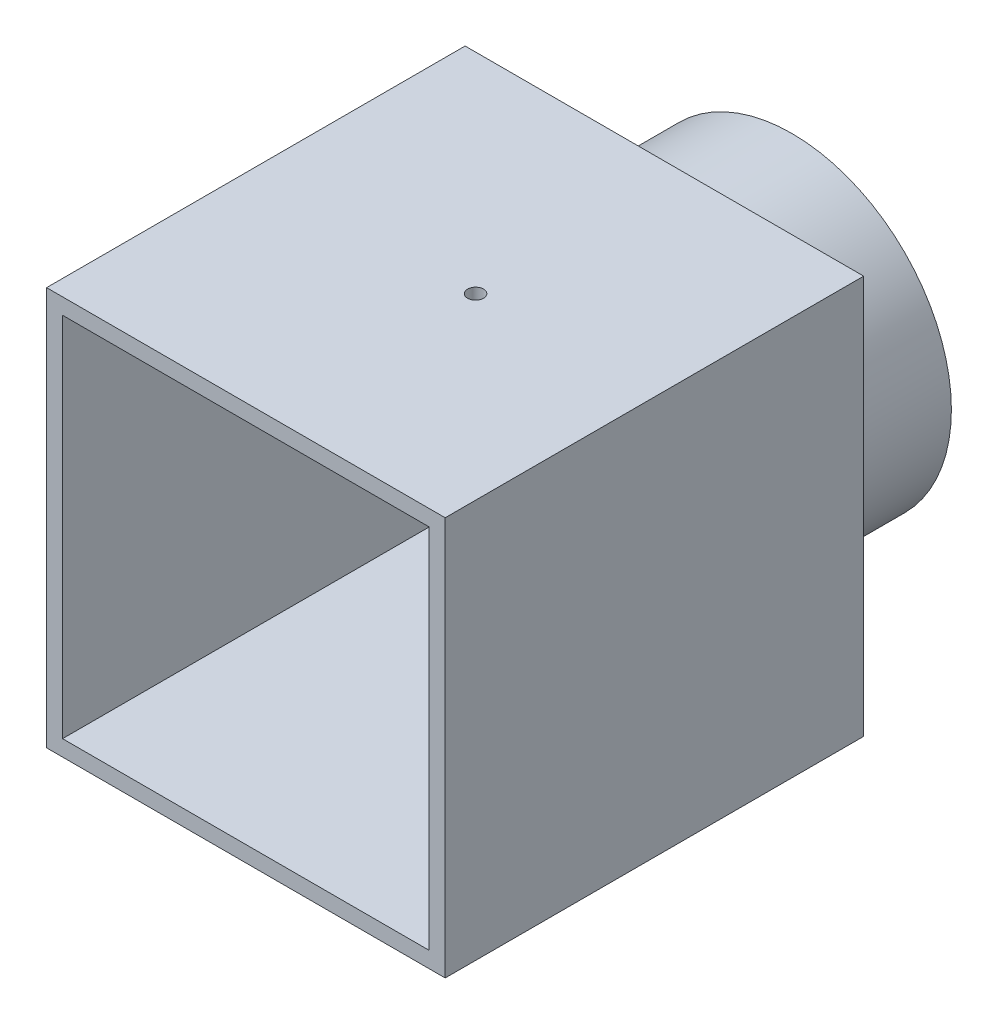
ISO-10303-21;
HEADER;
FILE_DESCRIPTION(('STEP AP214'),'2;1');
FILE_NAME('part.step','',(''),(''),'','','');
FILE_SCHEMA(('AUTOMOTIVE_DESIGN { 1 0 10303 214 1 1 1 1 }'));
ENDSEC;
DATA;
#1=APPLICATION_CONTEXT('core data for automotive mechanical design processes');
#2=APPLICATION_PROTOCOL_DEFINITION('international standard','automotive_design',2000,#1);
#3=PRODUCT_CONTEXT('',#1,'mechanical');
#4=PRODUCT('Part','Part','',(#3));
#5=PRODUCT_RELATED_PRODUCT_CATEGORY('part','',(#4));
#6=PRODUCT_DEFINITION_FORMATION('','',#4);
#7=PRODUCT_DEFINITION_CONTEXT('part definition',#1,'design');
#8=PRODUCT_DEFINITION('design','',#6,#7);
#9=PRODUCT_DEFINITION_SHAPE('','',#8);
#10=(LENGTH_UNIT() NAMED_UNIT(*) SI_UNIT(.MILLI.,.METRE.));
#11=(NAMED_UNIT(*) PLANE_ANGLE_UNIT() SI_UNIT($,.RADIAN.));
#12=(NAMED_UNIT(*) SI_UNIT($,.STERADIAN.) SOLID_ANGLE_UNIT());
#13=UNCERTAINTY_MEASURE_WITH_UNIT(LENGTH_MEASURE(1.E-05),#10,'distance_accuracy_value','');
#14=(GEOMETRIC_REPRESENTATION_CONTEXT(3) GLOBAL_UNCERTAINTY_ASSIGNED_CONTEXT((#13)) GLOBAL_UNIT_ASSIGNED_CONTEXT((#10,
#11,#12)) REPRESENTATION_CONTEXT('',''));
#15=CARTESIAN_POINT('',(0.,0.,0.));
#16=DIRECTION('',(0.,0.,1.));
#17=DIRECTION('',(1.,0.,0.));
#18=AXIS2_PLACEMENT_3D('',#15,#16,#17);
#19=CARTESIAN_POINT('',(46.,46.,105.));
#20=DIRECTION('',(-1.,0.,0.));
#21=DIRECTION('',(0.,-1.,0.));
#22=AXIS2_PLACEMENT_3D('',#19,#20,#21);
#23=PLANE('',#22);
#24=DIRECTION('',(0.,0.,-1.));
#25=VECTOR('',#24,1.);
#26=CARTESIAN_POINT('',(46.,46.,105.));
#27=LINE('',#26,#25);
#28=CARTESIAN_POINT('',(46.,46.,105.));
#29=VERTEX_POINT('',#28);
#30=CARTESIAN_POINT('',(46.,46.,4.));
#31=VERTEX_POINT('',#30);
#32=EDGE_CURVE('E115',#29,#31,#27,.T.);
#33=ORIENTED_EDGE('',*,*,#32,.T.);
#34=DIRECTION('',(0.,-1.,0.));
#35=VECTOR('',#34,1.);
#36=CARTESIAN_POINT('',(46.,46.,4.));
#37=LINE('',#36,#35);
#38=CARTESIAN_POINT('',(46.,-46.,4.));
#39=VERTEX_POINT('',#38);
#40=EDGE_CURVE('E99',#31,#39,#37,.T.);
#41=ORIENTED_EDGE('',*,*,#40,.T.);
#42=DIRECTION('',(0.,0.,-1.));
#43=VECTOR('',#42,1.);
#44=CARTESIAN_POINT('',(46.,-46.,105.));
#45=LINE('',#44,#43);
#46=CARTESIAN_POINT('',(46.,-46.,105.));
#47=VERTEX_POINT('',#46);
#48=EDGE_CURVE('E119',#47,#39,#45,.T.);
#49=ORIENTED_EDGE('',*,*,#48,.F.);
#50=DIRECTION('',(0.,1.,0.));
#51=VECTOR('',#50,1.);
#52=CARTESIAN_POINT('',(46.,46.,105.));
#53=LINE('',#52,#51);
#54=EDGE_CURVE('E176',#47,#29,#53,.T.);
#55=ORIENTED_EDGE('',*,*,#54,.T.);
#56=EDGE_LOOP('',(#33,#41,#49,#55));
#57=FACE_BOUND('',#56,.T.);
#58=ADVANCED_FACE('F33',(#57),#23,.T.);
#59=CARTESIAN_POINT('',(-46.,46.,105.));
#60=DIRECTION('',(0.,-1.,0.));
#61=DIRECTION('',(0.,0.,-1.));
#62=AXIS2_PLACEMENT_3D('',#59,#60,#61);
#63=PLANE('',#62);
#64=CARTESIAN_POINT('',(5.1155009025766,46.,52.5));
#65=DIRECTION('',(0.,-1.,0.));
#66=DIRECTION('',(0.,0.,-1.));
#67=AXIS2_PLACEMENT_3D('',#64,#65,#66);
#68=CIRCLE('',#67,2.);
#69=CARTESIAN_POINT('',(5.1155009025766,46.,50.5));
#70=VERTEX_POINT('',#69);
#71=EDGE_CURVE('E196',#70,#70,#68,.T.);
#72=ORIENTED_EDGE('',*,*,#71,.F.);
#73=EDGE_LOOP('',(#72));
#74=FACE_BOUND('',#73,.T.);
#75=DIRECTION('',(0.,0.,-1.));
#76=VECTOR('',#75,1.);
#77=CARTESIAN_POINT('',(-46.,46.,105.));
#78=LINE('',#77,#76);
#79=CARTESIAN_POINT('',(-46.,46.,105.));
#80=VERTEX_POINT('',#79);
#81=CARTESIAN_POINT('',(-46.,46.,4.));
#82=VERTEX_POINT('',#81);
#83=EDGE_CURVE('E108',#80,#82,#78,.T.);
#84=ORIENTED_EDGE('',*,*,#83,.T.);
#85=DIRECTION('',(1.,0.,0.));
#86=VECTOR('',#85,1.);
#87=CARTESIAN_POINT('',(46.,46.,4.));
#88=LINE('',#87,#86);
#89=EDGE_CURVE('E96',#82,#31,#88,.T.);
#90=ORIENTED_EDGE('',*,*,#89,.T.);
#91=ORIENTED_EDGE('',*,*,#32,.F.);
#92=DIRECTION('',(-1.,0.,0.));
#93=VECTOR('',#92,1.);
#94=CARTESIAN_POINT('',(-46.,46.,105.));
#95=LINE('',#94,#93);
#96=EDGE_CURVE('E114',#29,#80,#95,.T.);
#97=ORIENTED_EDGE('',*,*,#96,.T.);
#98=EDGE_LOOP('',(#84,#90,#91,#97));
#99=FACE_BOUND('',#98,.T.);
#100=ADVANCED_FACE('F112',(#74,#99),#63,.T.);
#101=CARTESIAN_POINT('',(-46.,46.,105.));
#102=DIRECTION('',(1.,0.,0.));
#103=DIRECTION('',(0.,1.,0.));
#104=AXIS2_PLACEMENT_3D('',#101,#102,#103);
#105=PLANE('',#104);
#106=DIRECTION('',(0.,0.,-1.));
#107=VECTOR('',#106,1.);
#108=CARTESIAN_POINT('',(-46.,-46.,105.));
#109=LINE('',#108,#107);
#110=CARTESIAN_POINT('',(-46.,-46.,105.));
#111=VERTEX_POINT('',#110);
#112=CARTESIAN_POINT('',(-46.,-46.,4.));
#113=VERTEX_POINT('',#112);
#114=EDGE_CURVE('E55',#111,#113,#109,.T.);
#115=ORIENTED_EDGE('',*,*,#114,.T.);
#116=DIRECTION('',(0.,1.,0.));
#117=VECTOR('',#116,1.);
#118=CARTESIAN_POINT('',(-46.,46.,4.));
#119=LINE('',#118,#117);
#120=EDGE_CURVE('E48',#113,#82,#119,.T.);
#121=ORIENTED_EDGE('',*,*,#120,.T.);
#122=ORIENTED_EDGE('',*,*,#83,.F.);
#123=DIRECTION('',(0.,-1.,0.));
#124=VECTOR('',#123,1.);
#125=CARTESIAN_POINT('',(-46.,46.,105.));
#126=LINE('',#125,#124);
#127=EDGE_CURVE('E177',#80,#111,#126,.T.);
#128=ORIENTED_EDGE('',*,*,#127,.T.);
#129=EDGE_LOOP('',(#115,#121,#122,#128));
#130=FACE_BOUND('',#129,.T.);
#131=ADVANCED_FACE('F107',(#130),#105,.T.);
#132=CARTESIAN_POINT('',(-46.,-46.,105.));
#133=DIRECTION('',(0.,1.,0.));
#134=DIRECTION('',(0.,0.,1.));
#135=AXIS2_PLACEMENT_3D('',#132,#133,#134);
#136=PLANE('',#135);
#137=ORIENTED_EDGE('',*,*,#48,.T.);
#138=DIRECTION('',(-1.,0.,0.));
#139=VECTOR('',#138,1.);
#140=CARTESIAN_POINT('',(46.,-46.,4.));
#141=LINE('',#140,#139);
#142=EDGE_CURVE('E181',#39,#113,#141,.T.);
#143=ORIENTED_EDGE('',*,*,#142,.T.);
#144=ORIENTED_EDGE('',*,*,#114,.F.);
#145=DIRECTION('',(1.,0.,0.));
#146=VECTOR('',#145,1.);
#147=CARTESIAN_POINT('',(-46.,-46.,105.));
#148=LINE('',#147,#146);
#149=EDGE_CURVE('E179',#111,#47,#148,.T.);
#150=ORIENTED_EDGE('',*,*,#149,.T.);
#151=EDGE_LOOP('',(#137,#143,#144,#150));
#152=FACE_BOUND('',#151,.T.);
#153=ADVANCED_FACE('F172',(#152),#136,.T.);
#154=CARTESIAN_POINT('',(0.,0.,105.));
#155=DIRECTION('',(0.,0.,1.));
#156=DIRECTION('',(1.,0.,0.));
#157=AXIS2_PLACEMENT_3D('',#154,#155,#156);
#158=PLANE('',#157);
#159=DIRECTION('',(0.,1.,0.));
#160=VECTOR('',#159,1.);
#161=CARTESIAN_POINT('',(50.,50.,105.));
#162=LINE('',#161,#160);
#163=CARTESIAN_POINT('',(50.,-50.,105.));
#164=VERTEX_POINT('',#163);
#165=CARTESIAN_POINT('',(50.,50.,105.));
#166=VERTEX_POINT('',#165);
#167=EDGE_CURVE('E123',#164,#166,#162,.T.);
#168=ORIENTED_EDGE('',*,*,#167,.T.);
#169=DIRECTION('',(-1.,0.,0.));
#170=VECTOR('',#169,1.);
#171=CARTESIAN_POINT('',(-50.,50.,105.));
#172=LINE('',#171,#170);
#173=CARTESIAN_POINT('',(-50.,50.,105.));
#174=VERTEX_POINT('',#173);
#175=EDGE_CURVE('E126',#166,#174,#172,.T.);
#176=ORIENTED_EDGE('',*,*,#175,.T.);
#177=DIRECTION('',(0.,-1.,0.));
#178=VECTOR('',#177,1.);
#179=CARTESIAN_POINT('',(-50.,50.,105.));
#180=LINE('',#179,#178);
#181=CARTESIAN_POINT('',(-50.,-50.,105.));
#182=VERTEX_POINT('',#181);
#183=EDGE_CURVE('E129',#174,#182,#180,.T.);
#184=ORIENTED_EDGE('',*,*,#183,.T.);
#185=DIRECTION('',(1.,0.,0.));
#186=VECTOR('',#185,1.);
#187=CARTESIAN_POINT('',(-50.,-50.,105.));
#188=LINE('',#187,#186);
#189=EDGE_CURVE('E131',#182,#164,#188,.T.);
#190=ORIENTED_EDGE('',*,*,#189,.T.);
#191=EDGE_LOOP('',(#168,#176,#184,#190));
#192=FACE_BOUND('',#191,.T.);
#193=ORIENTED_EDGE('',*,*,#96,.F.);
#194=ORIENTED_EDGE('',*,*,#54,.F.);
#195=ORIENTED_EDGE('',*,*,#149,.F.);
#196=ORIENTED_EDGE('',*,*,#127,.F.);
#197=EDGE_LOOP('',(#193,#194,#195,#196));
#198=FACE_BOUND('',#197,.T.);
#199=ADVANCED_FACE('F169',(#192,#198),#158,.T.);
#200=CARTESIAN_POINT('',(0.,0.,0.));
#201=DIRECTION('',(0.,0.,1.));
#202=DIRECTION('',(1.,0.,0.));
#203=AXIS2_PLACEMENT_3D('',#200,#201,#202);
#204=PLANE('',#203);
#205=CARTESIAN_POINT('',(0.,0.,0.));
#206=DIRECTION('',(0.,0.,1.));
#207=DIRECTION('',(1.,0.,0.));
#208=AXIS2_PLACEMENT_3D('',#205,#206,#207);
#209=CIRCLE('',#208,40.);
#210=CARTESIAN_POINT('',(40.,0.,0.));
#211=VERTEX_POINT('',#210);
#212=EDGE_CURVE('E11',#211,#211,#209,.F.);
#213=ORIENTED_EDGE('',*,*,#212,.F.);
#214=EDGE_LOOP('',(#213));
#215=FACE_BOUND('',#214,.T.);
#216=DIRECTION('',(0.,1.,0.));
#217=VECTOR('',#216,1.);
#218=CARTESIAN_POINT('',(50.,50.,0.));
#219=LINE('',#218,#217);
#220=CARTESIAN_POINT('',(50.,-50.,0.));
#221=VERTEX_POINT('',#220);
#222=CARTESIAN_POINT('',(50.,50.,0.));
#223=VERTEX_POINT('',#222);
#224=EDGE_CURVE('E117',#221,#223,#219,.T.);
#225=ORIENTED_EDGE('',*,*,#224,.F.);
#226=DIRECTION('',(1.,0.,0.));
#227=VECTOR('',#226,1.);
#228=CARTESIAN_POINT('',(-50.,-50.,0.));
#229=LINE('',#228,#227);
#230=CARTESIAN_POINT('',(-50.,-50.,0.));
#231=VERTEX_POINT('',#230);
#232=EDGE_CURVE('E127',#231,#221,#229,.T.);
#233=ORIENTED_EDGE('',*,*,#232,.F.);
#234=DIRECTION('',(0.,-1.,0.));
#235=VECTOR('',#234,1.);
#236=CARTESIAN_POINT('',(-50.,50.,0.));
#237=LINE('',#236,#235);
#238=CARTESIAN_POINT('',(-50.,50.,0.));
#239=VERTEX_POINT('',#238);
#240=EDGE_CURVE('E138',#239,#231,#237,.T.);
#241=ORIENTED_EDGE('',*,*,#240,.F.);
#242=DIRECTION('',(-1.,0.,0.));
#243=VECTOR('',#242,1.);
#244=CARTESIAN_POINT('',(-50.,50.,0.));
#245=LINE('',#244,#243);
#246=EDGE_CURVE('E136',#223,#239,#245,.T.);
#247=ORIENTED_EDGE('',*,*,#246,.F.);
#248=EDGE_LOOP('',(#225,#233,#241,#247));
#249=FACE_BOUND('',#248,.T.);
#250=ADVANCED_FACE('F159',(#215,#249),#204,.F.);
#251=CARTESIAN_POINT('',(50.,50.,105.));
#252=DIRECTION('',(-1.,0.,0.));
#253=DIRECTION('',(0.,-1.,0.));
#254=AXIS2_PLACEMENT_3D('',#251,#252,#253);
#255=PLANE('',#254);
#256=ORIENTED_EDGE('',*,*,#224,.T.);
#257=DIRECTION('',(0.,0.,-1.));
#258=VECTOR('',#257,1.);
#259=CARTESIAN_POINT('',(50.,50.,105.));
#260=LINE('',#259,#258);
#261=EDGE_CURVE('E41',#166,#223,#260,.T.);
#262=ORIENTED_EDGE('',*,*,#261,.F.);
#263=ORIENTED_EDGE('',*,*,#167,.F.);
#264=DIRECTION('',(0.,0.,-1.));
#265=VECTOR('',#264,1.);
#266=CARTESIAN_POINT('',(50.,-50.,105.));
#267=LINE('',#266,#265);
#268=EDGE_CURVE('E133',#164,#221,#267,.T.);
#269=ORIENTED_EDGE('',*,*,#268,.T.);
#270=EDGE_LOOP('',(#256,#262,#263,#269));
#271=FACE_BOUND('',#270,.T.);
#272=ADVANCED_FACE('F35',(#271),#255,.F.);
#273=CARTESIAN_POINT('',(-50.,50.,105.));
#274=DIRECTION('',(0.,-1.,0.));
#275=DIRECTION('',(0.,0.,-1.));
#276=AXIS2_PLACEMENT_3D('',#273,#274,#275);
#277=PLANE('',#276);
#278=CARTESIAN_POINT('',(5.1155009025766,50.,52.5));
#279=DIRECTION('',(0.,1.,0.));
#280=DIRECTION('',(0.,0.,1.));
#281=AXIS2_PLACEMENT_3D('',#278,#279,#280);
#282=CIRCLE('',#281,2.);
#283=CARTESIAN_POINT('',(5.1155009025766,50.,54.5));
#284=VERTEX_POINT('',#283);
#285=EDGE_CURVE('E201',#284,#284,#282,.T.);
#286=ORIENTED_EDGE('',*,*,#285,.F.);
#287=EDGE_LOOP('',(#286));
#288=FACE_BOUND('',#287,.T.);
#289=ORIENTED_EDGE('',*,*,#246,.T.);
#290=DIRECTION('',(0.,0.,-1.));
#291=VECTOR('',#290,1.);
#292=CARTESIAN_POINT('',(-50.,50.,105.));
#293=LINE('',#292,#291);
#294=EDGE_CURVE('E146',#174,#239,#293,.T.);
#295=ORIENTED_EDGE('',*,*,#294,.F.);
#296=ORIENTED_EDGE('',*,*,#175,.F.);
#297=ORIENTED_EDGE('',*,*,#261,.T.);
#298=EDGE_LOOP('',(#289,#295,#296,#297));
#299=FACE_BOUND('',#298,.T.);
#300=ADVANCED_FACE('F151',(#288,#299),#277,.F.);
#301=CARTESIAN_POINT('',(-50.,50.,105.));
#302=DIRECTION('',(1.,0.,0.));
#303=DIRECTION('',(0.,1.,0.));
#304=AXIS2_PLACEMENT_3D('',#301,#302,#303);
#305=PLANE('',#304);
#306=ORIENTED_EDGE('',*,*,#240,.T.);
#307=DIRECTION('',(0.,0.,-1.));
#308=VECTOR('',#307,1.);
#309=CARTESIAN_POINT('',(-50.,-50.,105.));
#310=LINE('',#309,#308);
#311=EDGE_CURVE('E143',#182,#231,#310,.T.);
#312=ORIENTED_EDGE('',*,*,#311,.F.);
#313=ORIENTED_EDGE('',*,*,#183,.F.);
#314=ORIENTED_EDGE('',*,*,#294,.T.);
#315=EDGE_LOOP('',(#306,#312,#313,#314));
#316=FACE_BOUND('',#315,.T.);
#317=ADVANCED_FACE('F163',(#316),#305,.F.);
#318=CARTESIAN_POINT('',(-50.,-50.,105.));
#319=DIRECTION('',(0.,1.,0.));
#320=DIRECTION('',(0.,0.,1.));
#321=AXIS2_PLACEMENT_3D('',#318,#319,#320);
#322=PLANE('',#321);
#323=ORIENTED_EDGE('',*,*,#232,.T.);
#324=ORIENTED_EDGE('',*,*,#268,.F.);
#325=ORIENTED_EDGE('',*,*,#189,.F.);
#326=ORIENTED_EDGE('',*,*,#311,.T.);
#327=EDGE_LOOP('',(#323,#324,#325,#326));
#328=FACE_BOUND('',#327,.T.);
#329=ADVANCED_FACE('F167',(#328),#322,.F.);
#330=CARTESIAN_POINT('',(0.,0.,4.));
#331=DIRECTION('',(0.,0.,-1.));
#332=DIRECTION('',(-1.,0.,0.));
#333=AXIS2_PLACEMENT_3D('',#330,#331,#332);
#334=PLANE('',#333);
#335=ORIENTED_EDGE('',*,*,#120,.F.);
#336=ORIENTED_EDGE('',*,*,#142,.F.);
#337=ORIENTED_EDGE('',*,*,#40,.F.);
#338=ORIENTED_EDGE('',*,*,#89,.F.);
#339=EDGE_LOOP('',(#335,#336,#337,#338));
#340=FACE_BOUND('',#339,.T.);
#341=ADVANCED_FACE('F97',(#340),#334,.F.);
#342=CARTESIAN_POINT('',(0.,0.,-32.));
#343=DIRECTION('',(0.,0.,-1.));
#344=DIRECTION('',(-1.,0.,0.));
#345=AXIS2_PLACEMENT_3D('',#342,#343,#344);
#346=PLANE('',#345);
#347=CARTESIAN_POINT('',(0.,0.,-32.));
#348=DIRECTION('',(0.,0.,-1.));
#349=DIRECTION('',(-1.,0.,0.));
#350=AXIS2_PLACEMENT_3D('',#347,#348,#349);
#351=CIRCLE('',#350,40.);
#352=CARTESIAN_POINT('',(-40.,0.,-32.));
#353=VERTEX_POINT('',#352);
#354=EDGE_CURVE('E110',#353,#353,#351,.T.);
#355=ORIENTED_EDGE('',*,*,#354,.T.);
#356=EDGE_LOOP('',(#355));
#357=FACE_BOUND('',#356,.T.);
#358=CARTESIAN_POINT('',(0.,0.,-32.));
#359=DIRECTION('',(0.,0.,-1.));
#360=DIRECTION('',(-1.,0.,0.));
#361=AXIS2_PLACEMENT_3D('',#358,#359,#360);
#362=CIRCLE('',#361,36.);
#363=CARTESIAN_POINT('',(-36.,0.,-32.));
#364=VERTEX_POINT('',#363);
#365=EDGE_CURVE('E192',#364,#364,#362,.T.);
#366=ORIENTED_EDGE('',*,*,#365,.F.);
#367=EDGE_LOOP('',(#366));
#368=FACE_BOUND('',#367,.T.);
#369=ADVANCED_FACE('F232',(#357,#368),#346,.T.);
#370=CARTESIAN_POINT('',(0.,0.,-32.));
#371=DIRECTION('',(0.,0.,1.));
#372=DIRECTION('',(1.,0.,0.));
#373=AXIS2_PLACEMENT_3D('',#370,#371,#372);
#374=CYLINDRICAL_SURFACE('',#373,40.);
#375=ORIENTED_EDGE('',*,*,#354,.F.);
#376=EDGE_LOOP('',(#375));
#377=FACE_BOUND('',#376,.T.);
#378=ORIENTED_EDGE('',*,*,#212,.T.);
#379=EDGE_LOOP('',(#378));
#380=FACE_BOUND('',#379,.T.);
#381=ADVANCED_FACE('F237',(#377,#380),#374,.T.);
#382=CARTESIAN_POINT('',(0.,0.,-32.));
#383=DIRECTION('',(0.,0.,1.));
#384=DIRECTION('',(1.,0.,0.));
#385=AXIS2_PLACEMENT_3D('',#382,#383,#384);
#386=CYLINDRICAL_SURFACE('',#385,36.);
#387=ORIENTED_EDGE('',*,*,#365,.T.);
#388=EDGE_LOOP('',(#387));
#389=FACE_BOUND('',#388,.T.);
#390=CARTESIAN_POINT('',(0.,0.,0.));
#391=DIRECTION('',(0.,0.,-1.));
#392=DIRECTION('',(-1.,0.,0.));
#393=AXIS2_PLACEMENT_3D('',#390,#391,#392);
#394=CIRCLE('',#393,36.);
#395=CARTESIAN_POINT('',(-36.,0.,0.));
#396=VERTEX_POINT('',#395);
#397=EDGE_CURVE('E193',#396,#396,#394,.T.);
#398=ORIENTED_EDGE('',*,*,#397,.F.);
#399=EDGE_LOOP('',(#398));
#400=FACE_BOUND('',#399,.T.);
#401=ADVANCED_FACE('F301',(#389,#400),#386,.F.);
#402=ORIENTED_EDGE('',*,*,#397,.T.);
#403=EDGE_LOOP('',(#402));
#404=FACE_BOUND('',#403,.T.);
#405=ADVANCED_FACE('F227',(#404),#204,.F.);
#406=CARTESIAN_POINT('',(5.1155009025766,40.,52.5));
#407=DIRECTION('',(0.,1.,0.));
#408=DIRECTION('',(0.,0.,1.));
#409=AXIS2_PLACEMENT_3D('',#406,#407,#408);
#410=CYLINDRICAL_SURFACE('',#409,2.);
#411=ORIENTED_EDGE('',*,*,#71,.T.);
#412=EDGE_LOOP('',(#411));
#413=FACE_BOUND('',#412,.T.);
#414=ORIENTED_EDGE('',*,*,#285,.T.);
#415=EDGE_LOOP('',(#414));
#416=FACE_BOUND('',#415,.T.);
#417=ADVANCED_FACE('F205',(#413,#416),#410,.F.);
#418=CLOSED_SHELL('',(#58,#100,#131,#153,#199,#250,#272,#300,#317,#329,#341,#369,#381,#401,#405,#417));
#419=MANIFOLD_SOLID_BREP('B2',#418);
#420=ADVANCED_BREP_SHAPE_REPRESENTATION('',(#18,#419),#14);
#421=SHAPE_DEFINITION_REPRESENTATION(#9,#420);
ENDSEC;
END-ISO-10303-21;
